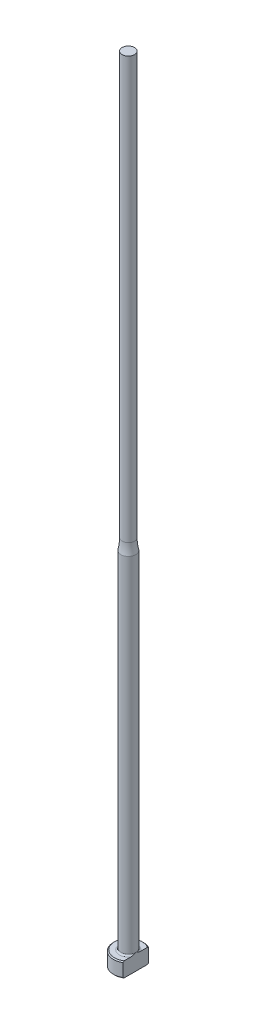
from build123d import *
from build123d.topology import SkipClean

# Parameters (mm, degrees)
CHAMFER1_SIZE = 0.2
FILLET1_R     = 0.3
KEY_DEPTH     = 161.056240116


with BuildPart() as part:
    # Sketch1 → Revolve1 (revolve)
    with BuildSketch(Plane.XY, mode=Mode.PRIVATE) as revolve1_sk:
        with BuildLine():
            Line((0, 0), (-3, 0))
            Line((-3, 0), (-3, 3))
            Line((-3, 3), (-1.5, 3))
            Line((-1.5, 3), (-1.5, 72.777951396))
            ThreePointArc((-1.5, 72.777951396), (-1.312696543, 73.881966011), (-1.25, 75))
            Line((-1.25, 75), (-1.25, 160))
            Line((-1.25, 160), (0, 160))
            Line((0, 160), (0, 0))
        make_face()
    revolve(revolve1_sk.sketch.rotate(Axis((0, 259.958771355, 0), (0, -1, 0)), 270), axis=Axis((0, 259.958771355, 0), (0, -1, 0)))

    # Chamfer1
    chamfer1_edges = [part.edges().sort_by_distance(p)[0] for p in [
        (0, 0, -3),
        (0, 3, -3),
    ]]
    chamfer(chamfer1_edges, length=CHAMFER1_SIZE)

    # Fillet1
    fillet1_edges = [part.edges().sort_by_distance(p)[0] for p in [
        (0, 3, -1.5),
    ]]
    fillet(fillet1_edges, radius=FILLET1_R)

    # Sketch2 → KEY (cut, through all)
    with SkipClean():  # the faces are left unmerged after this step: merging them gives an invalid solid
        with BuildSketch(Plane(origin=(0, 0, 0), x_dir=(1, 0, 0), z_dir=(0, 1, 0))):
            with BuildLine():
                Line((1.5, 2.598076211), (1.5, -2.598076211))
                ThreePointArc((1.5, -2.598076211), (3, 0), (1.5, 2.598076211))
            make_face()
        extrude(amount=KEY_DEPTH, mode=Mode.SUBTRACT)


solid = part.part
